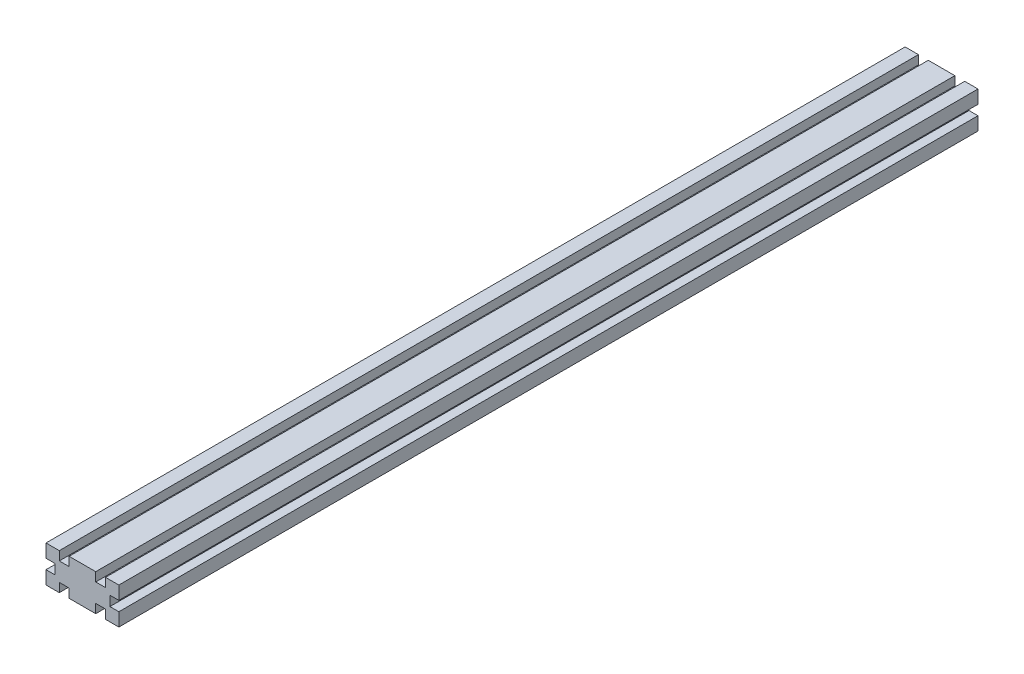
from build123d import *

# Parameters (mm, degrees)
SKIZZE1_W                       = 7.8
SKIZZE1_H                       = 8.6
AUFSATZ_LINEAR_AUSTRAGEN1_DEPTH = 750


with BuildPart() as part:
    # Skizze1 → Aufsatz-Linear austragen1 (new body)
    with BuildSketch(Plane.XY):
        Polygon((-7.8, 11.6), (0, 11.6), (0, 0), (-11.6, 0), (-11.6, 7.8), (-20.2, 7.8), (-20.2, 0), (-31.8, 0), (-31.8, 11.6), (-24, 11.6), (-24, 20.2), (-31.8, 20.2), (-31.8, 31.8), (-20.2, 31.8), (-20.2, 24), (-11.6, 24), (-11.6, 31.8), (0, 31.8), (0, 20.2), (-7.8, 20.2), align=None)
        with Locations((-3.9, 15.9)):
            Rectangle(SKIZZE1_W, SKIZZE1_H)
        with Locations((3.9, 15.9)):
            Rectangle(SKIZZE1_W, SKIZZE1_H)
        Polygon((31.8, 11.6), (31.8, 0), (20.2, 0), (20.2, 7.8), (11.6, 7.8), (11.6, 0), (0, 0), (0, 11.6), (7.8, 11.6), (7.8, 20.2), (0, 20.2), (0, 31.8), (11.6, 31.8), (11.6, 24), (20.2, 24), (20.2, 31.8), (31.8, 31.8), (31.8, 20.2), (24, 20.2), (24, 11.6), align=None)
    extrude(amount=AUFSATZ_LINEAR_AUSTRAGEN1_DEPTH)


solid = part.part
